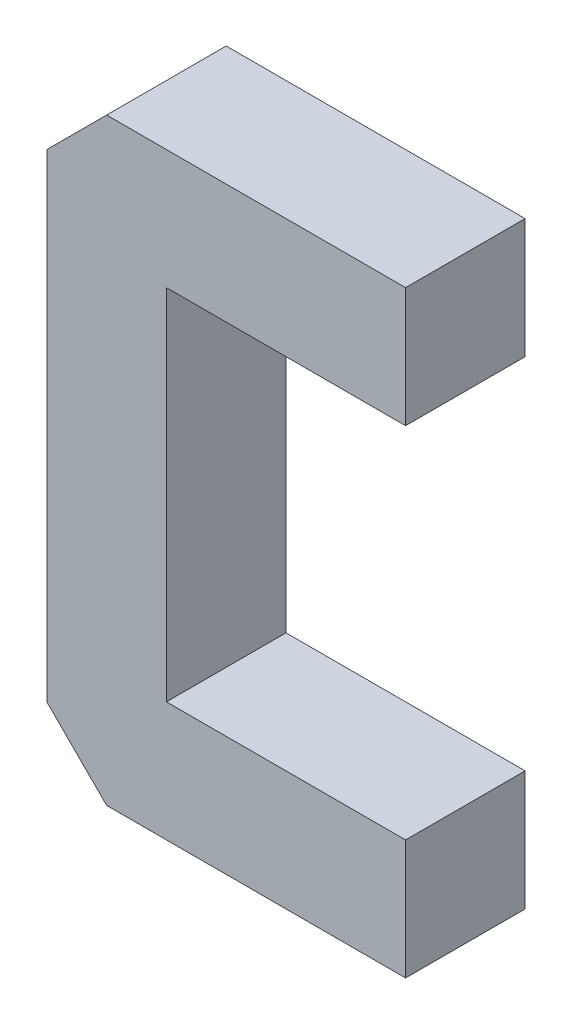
from build123d import *

# Parameters (mm, degrees)
BOSS_EXTRU_1_DEPTH = 10
CHANFREIN1_SIZE    = 5


with BuildPart() as part:
    # Esquisse1 → Boss.-Extru.1 (new body)
    with BuildSketch(Plane.XY):
        Polygon((30, 40), (30, 50), (0, 50), (0, 0), (30, 0), (30, 10), (10, 10), (10, 40), align=None)
    extrude(amount=BOSS_EXTRU_1_DEPTH)

    # Chanfrein1
    chanfrein1_edges = [part.edges().sort_by_distance(p)[0] for p in [
        (0, 50, 5),
        (0, 0, 5),
    ]]
    chamfer(chanfrein1_edges, length=CHANFREIN1_SIZE)


solid = part.part
